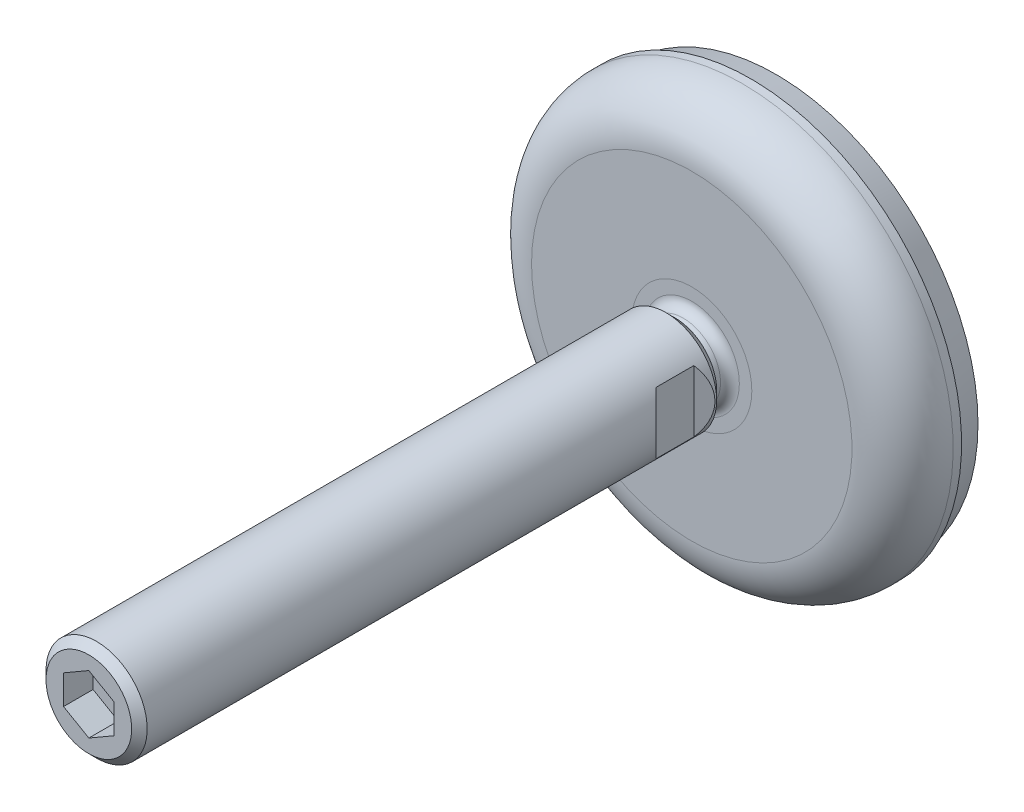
ISO-10303-21;
HEADER;
FILE_DESCRIPTION(('STEP AP214'),'2;1');
FILE_NAME('part.step','',(''),(''),'','','');
FILE_SCHEMA(('AUTOMOTIVE_DESIGN { 1 0 10303 214 1 1 1 1 }'));
ENDSEC;
DATA;
#1=APPLICATION_CONTEXT('core data for automotive mechanical design processes');
#2=APPLICATION_PROTOCOL_DEFINITION('international standard','automotive_design',2000,#1);
#3=PRODUCT_CONTEXT('',#1,'mechanical');
#4=PRODUCT('Part','Part','',(#3));
#5=PRODUCT_RELATED_PRODUCT_CATEGORY('part','',(#4));
#6=PRODUCT_DEFINITION_FORMATION('','',#4);
#7=PRODUCT_DEFINITION_CONTEXT('part definition',#1,'design');
#8=PRODUCT_DEFINITION('design','',#6,#7);
#9=PRODUCT_DEFINITION_SHAPE('','',#8);
#10=(LENGTH_UNIT() NAMED_UNIT(*) SI_UNIT(.MILLI.,.METRE.));
#11=(NAMED_UNIT(*) PLANE_ANGLE_UNIT() SI_UNIT($,.RADIAN.));
#12=(NAMED_UNIT(*) SI_UNIT($,.STERADIAN.) SOLID_ANGLE_UNIT());
#13=UNCERTAINTY_MEASURE_WITH_UNIT(LENGTH_MEASURE(1.E-05),#10,'distance_accuracy_value','');
#14=(GEOMETRIC_REPRESENTATION_CONTEXT(3) GLOBAL_UNCERTAINTY_ASSIGNED_CONTEXT((#13)) GLOBAL_UNIT_ASSIGNED_CONTEXT((#10,
#11,#12)) REPRESENTATION_CONTEXT('',''));
#15=CARTESIAN_POINT('',(0.,0.,0.));
#16=DIRECTION('',(0.,0.,1.));
#17=DIRECTION('',(1.,0.,0.));
#18=AXIS2_PLACEMENT_3D('',#15,#16,#17);
#19=CARTESIAN_POINT('',(-38.,38.,20.));
#20=CARTESIAN_POINT('',(-38.,-38.,20.));
#21=CARTESIAN_POINT('',(-38.,-38.76,20.));
#22=B_SPLINE_CURVE_WITH_KNOTS('',1,(#19,#20,#21),.UNSPECIFIED.,.F.,.F.,(2,1,2),(0.,1.,1.01),.UNSPECIFIED.);
#23=DIRECTION('',(1.,0.,0.));
#24=VECTOR('',#23,1.);
#25=SURFACE_OF_LINEAR_EXTRUSION('',#22,#24);
#26=CARTESIAN_POINT('',(0.,0.,20.));
#27=DIRECTION('',(0.,0.,1.));
#28=DIRECTION('',(1.,0.,0.));
#29=AXIS2_PLACEMENT_3D('',#26,#27,#28);
#30=CIRCLE('',#29,14.2492451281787);
#31=CARTESIAN_POINT('',(14.2492451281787,0.,20.));
#32=VERTEX_POINT('',#31);
#33=EDGE_CURVE('E514',#32,#32,#30,.T.);
#34=ORIENTED_EDGE('',*,*,#33,.F.);
#35=EDGE_LOOP('',(#34));
#36=FACE_BOUND('',#35,.T.);
#37=CARTESIAN_POINT('',(0.,0.,20.));
#38=DIRECTION('',(0.,0.,-1.));
#39=DIRECTION('',(-1.,0.,0.));
#40=AXIS2_PLACEMENT_3D('',#37,#38,#39);
#41=CIRCLE('',#40,38.);
#42=CARTESIAN_POINT('',(-38.,0.,20.));
#43=VERTEX_POINT('',#42);
#44=EDGE_CURVE('E205',#43,#43,#41,.T.);
#45=ORIENTED_EDGE('',*,*,#44,.F.);
#46=EDGE_LOOP('',(#45));
#47=FACE_BOUND('',#46,.T.);
#48=ADVANCED_FACE('F14',(#36,#47),#25,.T.);
#49=CARTESIAN_POINT('',(0.,0.,8.));
#50=DIRECTION('',(0.,0.,-1.));
#51=DIRECTION('',(-1.,0.,0.));
#52=AXIS2_PLACEMENT_3D('',#49,#50,#51);
#53=TOROIDAL_SURFACE('',#52,38.,12.);
#54=ORIENTED_EDGE('',*,*,#44,.T.);
#55=EDGE_LOOP('',(#54));
#56=FACE_BOUND('',#55,.T.);
#57=CARTESIAN_POINT('',(0.,0.,8.));
#58=DIRECTION('',(0.,0.,-1.));
#59=DIRECTION('',(0.,1.,0.));
#60=AXIS2_PLACEMENT_3D('',#57,#58,#59);
#61=CIRCLE('',#60,50.);
#62=CARTESIAN_POINT('',(0.,50.,8.));
#63=VERTEX_POINT('',#62);
#64=EDGE_CURVE('E201',#63,#63,#61,.T.);
#65=ORIENTED_EDGE('',*,*,#64,.F.);
#66=EDGE_LOOP('',(#65));
#67=FACE_BOUND('',#66,.T.);
#68=ADVANCED_FACE('F188',(#56,#67),#53,.T.);
#69=CARTESIAN_POINT('',(0.,0.,6.));
#70=DIRECTION('',(0.,0.,-1.));
#71=DIRECTION('',(-1.,0.,0.));
#72=AXIS2_PLACEMENT_3D('',#69,#70,#71);
#73=CYLINDRICAL_SURFACE('',#72,50.);
#74=CARTESIAN_POINT('',(0.,0.,6.));
#75=DIRECTION('',(0.,0.,-1.));
#76=DIRECTION('',(-1.,0.,0.));
#77=AXIS2_PLACEMENT_3D('',#74,#75,#76);
#78=CIRCLE('',#77,50.);
#79=CARTESIAN_POINT('',(-50.,0.,6.));
#80=VERTEX_POINT('',#79);
#81=EDGE_CURVE('E204',#80,#80,#78,.T.);
#82=ORIENTED_EDGE('',*,*,#81,.F.);
#83=EDGE_LOOP('',(#82));
#84=FACE_BOUND('',#83,.T.);
#85=ORIENTED_EDGE('',*,*,#64,.T.);
#86=EDGE_LOOP('',(#85));
#87=FACE_BOUND('',#86,.T.);
#88=ADVANCED_FACE('F184',(#84,#87),#73,.T.);
#89=CARTESIAN_POINT('',(-50.6000021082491,-50.,6.));
#90=DIRECTION('',(0.,0.,-1.));
#91=DIRECTION('',(0.,1.,0.));
#92=AXIS2_PLACEMENT_3D('',#89,#90,#91);
#93=PLANE('',#92);
#94=CARTESIAN_POINT('',(0.,0.,6.));
#95=DIRECTION('',(0.,0.,1.));
#96=DIRECTION('',(1.,0.,0.));
#97=AXIS2_PLACEMENT_3D('',#94,#95,#96);
#98=CIRCLE('',#97,49.5);
#99=CARTESIAN_POINT('',(49.5,0.,6.));
#100=VERTEX_POINT('',#99);
#101=EDGE_CURVE('E214',#100,#100,#98,.F.);
#102=ORIENTED_EDGE('',*,*,#101,.F.);
#103=EDGE_LOOP('',(#102));
#104=FACE_BOUND('',#103,.T.);
#105=ORIENTED_EDGE('',*,*,#81,.T.);
#106=EDGE_LOOP('',(#105));
#107=FACE_BOUND('',#106,.T.);
#108=ADVANCED_FACE('F176',(#104,#107),#93,.T.);
#109=CARTESIAN_POINT('',(-48.4670146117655,-47.8923048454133,0.));
#110=DIRECTION('',(0.,0.,-1.));
#111=DIRECTION('',(0.,1.,0.));
#112=AXIS2_PLACEMENT_3D('',#109,#110,#111);
#113=PLANE('',#112);
#114=CARTESIAN_POINT('',(0.,0.,0.));
#115=DIRECTION('',(0.,0.,1.));
#116=DIRECTION('',(1.,0.,0.));
#117=AXIS2_PLACEMENT_3D('',#114,#115,#116);
#118=CIRCLE('',#117,47.8923048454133);
#119=CARTESIAN_POINT('',(47.8923048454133,0.,0.));
#120=VERTEX_POINT('',#119);
#121=EDGE_CURVE('E210',#120,#120,#118,.T.);
#122=ORIENTED_EDGE('',*,*,#121,.F.);
#123=EDGE_LOOP('',(#122));
#124=FACE_BOUND('',#123,.T.);
#125=ADVANCED_FACE('F166',(#124),#113,.T.);
#126=CARTESIAN_POINT('',(0.,0.,0.));
#127=DIRECTION('',(0.,0.,1.));
#128=DIRECTION('',(1.,0.,0.));
#129=AXIS2_PLACEMENT_3D('',#126,#127,#128);
#130=CONICAL_SURFACE('',#129,47.8923048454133,0.261799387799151);
#131=ORIENTED_EDGE('',*,*,#101,.T.);
#132=EDGE_LOOP('',(#131));
#133=FACE_BOUND('',#132,.T.);
#134=ORIENTED_EDGE('',*,*,#121,.T.);
#135=EDGE_LOOP('',(#134));
#136=FACE_BOUND('',#135,.T.);
#137=ADVANCED_FACE('F163',(#133,#136),#130,.T.);
#138=CARTESIAN_POINT('',(0.,0.,19.908154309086));
#139=DIRECTION('',(0.,0.,1.));
#140=DIRECTION('',(1.,0.,0.));
#141=AXIS2_PLACEMENT_3D('',#138,#139,#140);
#142=DEGENERATE_TOROIDAL_SURFACE('',#141,1.96062186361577,11.,.F.);
#143=CARTESIAN_POINT('',(0.,0.,22.0200285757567));
#144=DIRECTION('',(0.,0.,1.));
#145=DIRECTION('',(1.,0.,0.));
#146=AXIS2_PLACEMENT_3D('',#143,#144,#145);
#147=CIRCLE('',#146,8.83474691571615);
#148=CARTESIAN_POINT('',(8.83474691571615,0.,22.0200285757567));
#149=VERTEX_POINT('',#148);
#150=EDGE_CURVE('E263',#149,#149,#147,.T.);
#151=ORIENTED_EDGE('',*,*,#150,.T.);
#152=EDGE_LOOP('',(#151));
#153=FACE_BOUND('',#152,.T.);
#154=CARTESIAN_POINT('',(0.,0.,24.));
#155=DIRECTION('',(0.,0.,1.));
#156=DIRECTION('',(1.,0.,0.));
#157=AXIS2_PLACEMENT_3D('',#154,#155,#156);
#158=CIRCLE('',#157,8.25);
#159=CARTESIAN_POINT('',(8.25,0.,24.));
#160=VERTEX_POINT('',#159);
#161=EDGE_CURVE('E261',#160,#160,#158,.T.);
#162=ORIENTED_EDGE('',*,*,#161,.F.);
#163=EDGE_LOOP('',(#162));
#164=FACE_BOUND('',#163,.T.);
#165=ADVANCED_FACE('F165',(#153,#164),#142,.F.);
#166=CARTESIAN_POINT('',(0.,0.,22.5));
#167=DIRECTION('',(0.,0.,1.));
#168=DIRECTION('',(1.,0.,0.));
#169=AXIS2_PLACEMENT_3D('',#166,#167,#168);
#170=TOROIDAL_SURFACE('',#169,11.2882398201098,2.5);
#171=CARTESIAN_POINT('',(0.,0.,20.));
#172=DIRECTION('',(0.,0.,1.));
#173=DIRECTION('',(1.,0.,0.));
#174=AXIS2_PLACEMENT_3D('',#171,#172,#173);
#175=CIRCLE('',#174,11.2882398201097);
#176=CARTESIAN_POINT('',(11.2882398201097,0.,20.));
#177=VERTEX_POINT('',#176);
#178=EDGE_CURVE('E268',#177,#177,#175,.T.);
#179=ORIENTED_EDGE('',*,*,#178,.T.);
#180=EDGE_LOOP('',(#179));
#181=FACE_BOUND('',#180,.T.);
#182=ORIENTED_EDGE('',*,*,#150,.F.);
#183=EDGE_LOOP('',(#182));
#184=FACE_BOUND('',#183,.T.);
#185=ADVANCED_FACE('F173',(#181,#184),#170,.F.);
#186=CARTESIAN_POINT('',(-14.2492451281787,0.,20.));
#187=DIRECTION('',(0.,0.,1.));
#188=DIRECTION('',(1.,0.,0.));
#189=AXIS2_PLACEMENT_3D('',#186,#187,#188);
#190=PLANE('',#189);
#191=ORIENTED_EDGE('',*,*,#33,.T.);
#192=EDGE_LOOP('',(#191));
#193=FACE_BOUND('',#192,.T.);
#194=ORIENTED_EDGE('',*,*,#178,.F.);
#195=EDGE_LOOP('',(#194));
#196=FACE_BOUND('',#195,.T.);
#197=ADVANCED_FACE('F341',(#193,#196),#190,.T.);
#198=CARTESIAN_POINT('',(-6.,-7.01134166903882,156.));
#199=DIRECTION('',(0.,0.,1.));
#200=DIRECTION('',(1.,0.,0.));
#201=AXIS2_PLACEMENT_3D('',#198,#199,#200);
#202=PLANE('',#201);
#203=DIRECTION('',(0.866025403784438,0.5,0.));
#204=VECTOR('',#203,1.);
#205=CARTESIAN_POINT('',(-3.,5.19615242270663,156.));
#206=LINE('',#205,#204);
#207=CARTESIAN_POINT('',(-6.,3.46410161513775,156.));
#208=VERTEX_POINT('',#207);
#209=CARTESIAN_POINT('',(1.08255773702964E-07,6.92820316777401,156.));
#210=VERTEX_POINT('',#209);
#211=EDGE_CURVE('E138',#208,#210,#206,.T.);
#212=ORIENTED_EDGE('',*,*,#211,.F.);
#213=DIRECTION('',(0.,1.,0.));
#214=VECTOR('',#213,1.);
#215=CARTESIAN_POINT('',(-6.,0.,156.));
#216=LINE('',#215,#214);
#217=CARTESIAN_POINT('',(-6.,-3.46410161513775,156.));
#218=VERTEX_POINT('',#217);
#219=EDGE_CURVE('E72',#218,#208,#216,.T.);
#220=ORIENTED_EDGE('',*,*,#219,.F.);
#221=DIRECTION('',(-0.866025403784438,0.5,0.));
#222=VECTOR('',#221,1.);
#223=CARTESIAN_POINT('',(-3.,-5.19615242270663,156.));
#224=LINE('',#223,#222);
#225=CARTESIAN_POINT('',(-2.16511547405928E-07,-6.92820310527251,156.));
#226=VERTEX_POINT('',#225);
#227=EDGE_CURVE('E68',#226,#218,#224,.T.);
#228=ORIENTED_EDGE('',*,*,#227,.F.);
#229=DIRECTION('',(-0.866025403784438,-0.5,0.));
#230=VECTOR('',#229,1.);
#231=CARTESIAN_POINT('',(3.,-5.19615242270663,156.));
#232=LINE('',#231,#230);
#233=CARTESIAN_POINT('',(6.,-3.46410161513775,156.));
#234=VERTEX_POINT('',#233);
#235=EDGE_CURVE('E91',#234,#226,#232,.T.);
#236=ORIENTED_EDGE('',*,*,#235,.F.);
#237=DIRECTION('',(0.,-1.,0.));
#238=VECTOR('',#237,1.);
#239=CARTESIAN_POINT('',(6.,0.,156.));
#240=LINE('',#239,#238);
#241=CARTESIAN_POINT('',(6.,3.46410161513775,156.));
#242=VERTEX_POINT('',#241);
#243=EDGE_CURVE('E149',#242,#234,#240,.T.);
#244=ORIENTED_EDGE('',*,*,#243,.F.);
#245=DIRECTION('',(0.866025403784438,-0.5,0.));
#246=VECTOR('',#245,1.);
#247=CARTESIAN_POINT('',(3.,5.19615242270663,156.));
#248=LINE('',#247,#246);
#249=EDGE_CURVE('E142',#210,#242,#248,.T.);
#250=ORIENTED_EDGE('',*,*,#249,.F.);
#251=EDGE_LOOP('',(#212,#220,#228,#236,#244,#250));
#252=FACE_BOUND('',#251,.T.);
#253=ADVANCED_FACE('F338',(#252),#202,.T.);
#254=CARTESIAN_POINT('',(6.,3.46410161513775,163.));
#255=DIRECTION('',(-0.5,-0.866025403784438,0.));
#256=DIRECTION('',(-0.866025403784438,0.5,0.));
#257=AXIS2_PLACEMENT_3D('',#254,#255,#256);
#258=PLANE('',#257);
#259=ORIENTED_EDGE('',*,*,#249,.T.);
#260=DIRECTION('',(0.,0.,-1.));
#261=VECTOR('',#260,1.);
#262=CARTESIAN_POINT('',(6.,3.46410161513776,163.));
#263=LINE('',#262,#261);
#264=CARTESIAN_POINT('',(6.,3.46410161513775,163.));
#265=VERTEX_POINT('',#264);
#266=EDGE_CURVE('E146',#265,#242,#263,.T.);
#267=ORIENTED_EDGE('',*,*,#266,.F.);
#268=CARTESIAN_POINT('',(0.,6.92820323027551,163.));
#269=CARTESIAN_POINT('',(0.25,6.7838656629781,163.));
#270=CARTESIAN_POINT('',(0.5,6.6395280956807,163.));
#271=CARTESIAN_POINT('',(1.,6.35085296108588,163.));
#272=CARTESIAN_POINT('',(1.25,6.20651539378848,163.));
#273=CARTESIAN_POINT('',(1.75,5.91784025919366,163.));
#274=CARTESIAN_POINT('',(2.,5.77350269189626,163.));
#275=CARTESIAN_POINT('',(2.5,5.48482755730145,163.));
#276=CARTESIAN_POINT('',(2.75,5.34048999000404,163.));
#277=CARTESIAN_POINT('',(3.25,5.05181485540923,163.));
#278=CARTESIAN_POINT('',(3.5,4.90747728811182,163.));
#279=CARTESIAN_POINT('',(4.,4.61880215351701,163.));
#280=CARTESIAN_POINT('',(4.25,4.4744645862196,163.));
#281=CARTESIAN_POINT('',(4.75,4.18578945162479,163.));
#282=CARTESIAN_POINT('',(5.,4.04145188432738,163.));
#283=CARTESIAN_POINT('',(5.5,3.75277674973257,163.));
#284=CARTESIAN_POINT('',(5.75,3.60843918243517,163.));
#285=CARTESIAN_POINT('',(6.,3.46410161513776,163.));
#286=B_SPLINE_CURVE_WITH_KNOTS('',3,(#268,#269,#270,#271,#272,#273,#274,#275,#276,#277,#278,
#279,#280,#281,#282,#283,#284,#285),.UNSPECIFIED.,.F.,.F.,(4,2,2,2,2,2,2,2,4),(0.,
0.86602540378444,1.73205080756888,2.59807621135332,3.46410161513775,4.33012701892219,
5.19615242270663,6.06217782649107,6.92820323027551),.UNSPECIFIED.);
#287=CARTESIAN_POINT('',(-6.25386938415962E-08,6.92820319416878,163.));
#288=VERTEX_POINT('',#287);
#289=EDGE_CURVE('E120',#288,#265,#286,.T.);
#290=ORIENTED_EDGE('',*,*,#289,.F.);
#291=DIRECTION('',(0.,0.,-1.));
#292=VECTOR('',#291,1.);
#293=CARTESIAN_POINT('',(0.,6.92820323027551,163.));
#294=LINE('',#293,#292);
#295=EDGE_CURVE('E135',#288,#210,#294,.T.);
#296=ORIENTED_EDGE('',*,*,#295,.T.);
#297=EDGE_LOOP('',(#259,#267,#290,#296));
#298=FACE_BOUND('',#297,.T.);
#299=ADVANCED_FACE('F144',(#298),#258,.T.);
#300=CARTESIAN_POINT('',(0.,6.92820323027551,163.));
#301=DIRECTION('',(0.5,-0.866025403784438,0.));
#302=DIRECTION('',(-0.866025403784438,-0.5,0.));
#303=AXIS2_PLACEMENT_3D('',#300,#301,#302);
#304=PLANE('',#303);
#305=ORIENTED_EDGE('',*,*,#211,.T.);
#306=ORIENTED_EDGE('',*,*,#295,.F.);
#307=CARTESIAN_POINT('',(-6.,3.46410161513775,163.));
#308=CARTESIAN_POINT('',(-5.75,3.60843918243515,163.));
#309=CARTESIAN_POINT('',(-5.5,3.75277674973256,163.));
#310=CARTESIAN_POINT('',(-5.,4.04145188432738,163.));
#311=CARTESIAN_POINT('',(-4.75,4.18578945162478,163.));
#312=CARTESIAN_POINT('',(-4.25,4.4744645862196,163.));
#313=CARTESIAN_POINT('',(-4.,4.618802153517,163.));
#314=CARTESIAN_POINT('',(-3.5,4.90747728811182,163.));
#315=CARTESIAN_POINT('',(-3.25,5.05181485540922,163.));
#316=CARTESIAN_POINT('',(-2.75,5.34048999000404,163.));
#317=CARTESIAN_POINT('',(-2.5,5.48482755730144,163.));
#318=CARTESIAN_POINT('',(-2.,5.77350269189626,163.));
#319=CARTESIAN_POINT('',(-1.75,5.91784025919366,163.));
#320=CARTESIAN_POINT('',(-1.25,6.20651539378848,163.));
#321=CARTESIAN_POINT('',(-1.,6.35085296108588,163.));
#322=CARTESIAN_POINT('',(-0.5,6.63952809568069,163.));
#323=CARTESIAN_POINT('',(-0.249999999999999,6.7838656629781,163.));
#324=CARTESIAN_POINT('',(0.,6.92820323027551,163.));
#325=B_SPLINE_CURVE_WITH_KNOTS('',3,(#307,#308,#309,#310,#311,#312,#313,#314,#315,#316,#317,
#318,#319,#320,#321,#322,#323,#324),.UNSPECIFIED.,.F.,.F.,(4,2,2,2,2,2,2,2,4),(0.,
0.866025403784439,1.73205080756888,2.59807621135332,3.46410161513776,4.33012701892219,
5.19615242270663,6.06217782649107,6.92820323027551),.UNSPECIFIED.);
#326=CARTESIAN_POINT('',(-6.,3.46410161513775,163.));
#327=VERTEX_POINT('',#326);
#328=EDGE_CURVE('E82',#327,#288,#325,.T.);
#329=ORIENTED_EDGE('',*,*,#328,.F.);
#330=DIRECTION('',(0.,0.,-1.));
#331=VECTOR('',#330,1.);
#332=CARTESIAN_POINT('',(-6.,3.46410161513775,163.));
#333=LINE('',#332,#331);
#334=EDGE_CURVE('E78',#327,#208,#333,.T.);
#335=ORIENTED_EDGE('',*,*,#334,.T.);
#336=EDGE_LOOP('',(#305,#306,#329,#335));
#337=FACE_BOUND('',#336,.T.);
#338=ADVANCED_FACE('F132',(#337),#304,.T.);
#339=CARTESIAN_POINT('',(-6.,3.46410161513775,163.));
#340=DIRECTION('',(1.,0.,0.));
#341=DIRECTION('',(0.,-1.,0.));
#342=AXIS2_PLACEMENT_3D('',#339,#340,#341);
#343=PLANE('',#342);
#344=ORIENTED_EDGE('',*,*,#219,.T.);
#345=ORIENTED_EDGE('',*,*,#334,.F.);
#346=DIRECTION('',(0.,1.,0.));
#347=VECTOR('',#346,1.);
#348=CARTESIAN_POINT('',(-6.,0.,163.));
#349=LINE('',#348,#347);
#350=CARTESIAN_POINT('',(-6.,-3.46410161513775,163.));
#351=VERTEX_POINT('',#350);
#352=EDGE_CURVE('E75',#351,#327,#349,.T.);
#353=ORIENTED_EDGE('',*,*,#352,.F.);
#354=DIRECTION('',(0.,0.,-1.));
#355=VECTOR('',#354,1.);
#356=CARTESIAN_POINT('',(-6.,-3.46410161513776,163.));
#357=LINE('',#356,#355);
#358=EDGE_CURVE('E59',#351,#218,#357,.T.);
#359=ORIENTED_EDGE('',*,*,#358,.T.);
#360=EDGE_LOOP('',(#344,#345,#353,#359));
#361=FACE_BOUND('',#360,.T.);
#362=ADVANCED_FACE('F76',(#361),#343,.T.);
#363=CARTESIAN_POINT('',(-6.,-3.46410161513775,163.));
#364=DIRECTION('',(0.5,0.866025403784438,0.));
#365=DIRECTION('',(0.866025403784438,-0.5,0.));
#366=AXIS2_PLACEMENT_3D('',#363,#364,#365);
#367=PLANE('',#366);
#368=ORIENTED_EDGE('',*,*,#227,.T.);
#369=ORIENTED_EDGE('',*,*,#358,.F.);
#370=CARTESIAN_POINT('',(0.,-6.92820323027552,163.));
#371=CARTESIAN_POINT('',(-0.250000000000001,-6.78386566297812,163.));
#372=CARTESIAN_POINT('',(-0.500000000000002,-6.63952809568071,163.));
#373=CARTESIAN_POINT('',(-1.,-6.3508529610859,163.));
#374=CARTESIAN_POINT('',(-1.25,-6.20651539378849,163.));
#375=CARTESIAN_POINT('',(-1.75,-5.91784025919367,163.));
#376=CARTESIAN_POINT('',(-2.,-5.77350269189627,163.));
#377=CARTESIAN_POINT('',(-2.5,-5.48482755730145,163.));
#378=CARTESIAN_POINT('',(-2.75,-5.34048999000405,163.));
#379=CARTESIAN_POINT('',(-3.25,-5.05181485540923,163.));
#380=CARTESIAN_POINT('',(-3.5,-4.90747728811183,163.));
#381=CARTESIAN_POINT('',(-4.,-4.61880215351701,163.));
#382=CARTESIAN_POINT('',(-4.25,-4.47446458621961,163.));
#383=CARTESIAN_POINT('',(-4.75,-4.18578945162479,163.));
#384=CARTESIAN_POINT('',(-5.,-4.04145188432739,163.));
#385=CARTESIAN_POINT('',(-5.5,-3.75277674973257,163.));
#386=CARTESIAN_POINT('',(-5.75,-3.60843918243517,163.));
#387=CARTESIAN_POINT('',(-6.,-3.46410161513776,163.));
#388=B_SPLINE_CURVE_WITH_KNOTS('',3,(#370,#371,#372,#373,#374,#375,#376,#377,#378,#379,#380,
#381,#382,#383,#384,#385,#386,#387),.UNSPECIFIED.,.F.,.F.,(4,2,2,2,2,2,2,2,4),(0.,
0.86602540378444,1.73205080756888,2.59807621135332,3.46410161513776,4.3301270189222,
5.19615242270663,6.06217782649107,6.92820323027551),.UNSPECIFIED.);
#389=CARTESIAN_POINT('',(-6.25386938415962E-08,-6.92820319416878,163.));
#390=VERTEX_POINT('',#389);
#391=EDGE_CURVE('E64',#390,#351,#388,.T.);
#392=ORIENTED_EDGE('',*,*,#391,.F.);
#393=DIRECTION('',(0.,0.,-1.));
#394=VECTOR('',#393,1.);
#395=CARTESIAN_POINT('',(0.,-6.92820323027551,163.));
#396=LINE('',#395,#394);
#397=EDGE_CURVE('E89',#226,#390,#396,.F.);
#398=ORIENTED_EDGE('',*,*,#397,.F.);
#399=EDGE_LOOP('',(#368,#369,#392,#398));
#400=FACE_BOUND('',#399,.T.);
#401=ADVANCED_FACE('F61',(#400),#367,.T.);
#402=CARTESIAN_POINT('',(0.,-6.92820323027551,163.));
#403=DIRECTION('',(-0.5,0.866025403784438,0.));
#404=DIRECTION('',(0.866025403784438,0.5,0.));
#405=AXIS2_PLACEMENT_3D('',#402,#403,#404);
#406=PLANE('',#405);
#407=ORIENTED_EDGE('',*,*,#235,.T.);
#408=ORIENTED_EDGE('',*,*,#397,.T.);
#409=CARTESIAN_POINT('',(6.,-3.46410161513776,163.));
#410=CARTESIAN_POINT('',(5.75,-3.60843918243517,163.));
#411=CARTESIAN_POINT('',(5.5,-3.75277674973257,163.));
#412=CARTESIAN_POINT('',(5.,-4.04145188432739,163.));
#413=CARTESIAN_POINT('',(4.75,-4.18578945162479,163.));
#414=CARTESIAN_POINT('',(4.25,-4.47446458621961,163.));
#415=CARTESIAN_POINT('',(4.,-4.61880215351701,163.));
#416=CARTESIAN_POINT('',(3.5,-4.90747728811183,163.));
#417=CARTESIAN_POINT('',(3.25,-5.05181485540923,163.));
#418=CARTESIAN_POINT('',(2.75,-5.34048999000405,163.));
#419=CARTESIAN_POINT('',(2.5,-5.48482755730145,163.));
#420=CARTESIAN_POINT('',(2.,-5.77350269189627,163.));
#421=CARTESIAN_POINT('',(1.75,-5.91784025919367,163.));
#422=CARTESIAN_POINT('',(1.25,-6.20651539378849,163.));
#423=CARTESIAN_POINT('',(0.999999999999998,-6.3508529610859,163.));
#424=CARTESIAN_POINT('',(0.499999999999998,-6.63952809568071,163.));
#425=CARTESIAN_POINT('',(0.249999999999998,-6.78386566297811,163.));
#426=CARTESIAN_POINT('',(0.,-6.92820323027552,163.));
#427=B_SPLINE_CURVE_WITH_KNOTS('',3,(#409,#410,#411,#412,#413,#414,#415,#416,#417,#418,#419,
#420,#421,#422,#423,#424,#425,#426),.UNSPECIFIED.,.F.,.F.,(4,2,2,2,2,2,2,2,4),(0.,
0.866025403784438,1.73205080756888,2.59807621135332,3.46410161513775,4.33012701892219,
5.19615242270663,6.06217782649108,6.92820323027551),.UNSPECIFIED.);
#428=CARTESIAN_POINT('',(6.,-3.46410161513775,163.));
#429=VERTEX_POINT('',#428);
#430=EDGE_CURVE('E88',#429,#390,#427,.T.);
#431=ORIENTED_EDGE('',*,*,#430,.F.);
#432=DIRECTION('',(0.,0.,-1.));
#433=VECTOR('',#432,1.);
#434=CARTESIAN_POINT('',(6.,-3.46410161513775,163.));
#435=LINE('',#434,#433);
#436=EDGE_CURVE('E37',#429,#234,#435,.T.);
#437=ORIENTED_EDGE('',*,*,#436,.T.);
#438=EDGE_LOOP('',(#407,#408,#431,#437));
#439=FACE_BOUND('',#438,.T.);
#440=ADVANCED_FACE('F111',(#439),#406,.T.);
#441=CARTESIAN_POINT('',(6.,-3.46410161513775,163.));
#442=DIRECTION('',(-1.,0.,0.));
#443=DIRECTION('',(0.,1.,0.));
#444=AXIS2_PLACEMENT_3D('',#441,#442,#443);
#445=PLANE('',#444);
#446=ORIENTED_EDGE('',*,*,#243,.T.);
#447=ORIENTED_EDGE('',*,*,#436,.F.);
#448=DIRECTION('',(0.,-1.,0.));
#449=VECTOR('',#448,1.);
#450=CARTESIAN_POINT('',(6.,0.,163.));
#451=LINE('',#450,#449);
#452=EDGE_CURVE('E123',#265,#429,#451,.T.);
#453=ORIENTED_EDGE('',*,*,#452,.F.);
#454=ORIENTED_EDGE('',*,*,#266,.T.);
#455=EDGE_LOOP('',(#446,#447,#453,#454));
#456=FACE_BOUND('',#455,.T.);
#457=ADVANCED_FACE('F151',(#456),#445,.T.);
#458=CARTESIAN_POINT('',(-10.2814161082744,10.1595,163.));
#459=DIRECTION('',(0.,0.,1.));
#460=DIRECTION('',(0.,-1.,0.));
#461=AXIS2_PLACEMENT_3D('',#458,#459,#460);
#462=PLANE('',#461);
#463=ORIENTED_EDGE('',*,*,#452,.T.);
#464=ORIENTED_EDGE('',*,*,#430,.T.);
#465=ORIENTED_EDGE('',*,*,#391,.T.);
#466=ORIENTED_EDGE('',*,*,#352,.T.);
#467=ORIENTED_EDGE('',*,*,#328,.T.);
#468=ORIENTED_EDGE('',*,*,#289,.T.);
#469=EDGE_LOOP('',(#463,#464,#465,#466,#467,#468));
#470=FACE_BOUND('',#469,.T.);
#471=CARTESIAN_POINT('',(0.,0.,163.));
#472=DIRECTION('',(0.,0.,-1.));
#473=DIRECTION('',(-1.,0.,0.));
#474=AXIS2_PLACEMENT_3D('',#471,#472,#473);
#475=CIRCLE('',#474,10.1595);
#476=CARTESIAN_POINT('',(-10.1595,0.,163.));
#477=VERTEX_POINT('',#476);
#478=EDGE_CURVE('E209',#477,#477,#475,.T.);
#479=ORIENTED_EDGE('',*,*,#478,.F.);
#480=EDGE_LOOP('',(#479));
#481=FACE_BOUND('',#480,.T.);
#482=ADVANCED_FACE('F86',(#470,#481),#462,.T.);
#483=CARTESIAN_POINT('',(0.,0.,163.));
#484=DIRECTION('',(0.,0.,-1.));
#485=DIRECTION('',(-1.,0.,0.));
#486=AXIS2_PLACEMENT_3D('',#483,#484,#485);
#487=CONICAL_SURFACE('',#486,10.1595,0.78539816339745);
#488=CARTESIAN_POINT('',(0.,0.,161.1595));
#489=DIRECTION('',(0.,0.,-1.));
#490=DIRECTION('',(0.,1.,0.));
#491=AXIS2_PLACEMENT_3D('',#488,#489,#490);
#492=CIRCLE('',#491,12.);
#493=CARTESIAN_POINT('',(0.,12.,161.1595));
#494=VERTEX_POINT('',#493);
#495=EDGE_CURVE('E206',#494,#494,#492,.T.);
#496=ORIENTED_EDGE('',*,*,#495,.F.);
#497=EDGE_LOOP('',(#496));
#498=FACE_BOUND('',#497,.T.);
#499=ORIENTED_EDGE('',*,*,#478,.T.);
#500=EDGE_LOOP('',(#499));
#501=FACE_BOUND('',#500,.T.);
#502=ADVANCED_FACE('F160',(#498,#501),#487,.T.);
#503=CARTESIAN_POINT('',(-9.5,-15.,38.));
#504=DIRECTION('',(0.707106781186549,0.,0.707106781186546));
#505=DIRECTION('',(0.707106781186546,0.,-0.707106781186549));
#506=AXIS2_PLACEMENT_3D('',#503,#504,#505);
#507=PLANE('',#506);
#508=DIRECTION('',(0.,1.,0.));
#509=VECTOR('',#508,1.);
#510=CARTESIAN_POINT('',(-9.5,-15.,38.));
#511=LINE('',#510,#509);
#512=CARTESIAN_POINT('',(-9.5,-7.33143914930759,38.));
#513=VERTEX_POINT('',#512);
#514=CARTESIAN_POINT('',(-9.5,7.33143914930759,38.));
#515=VERTEX_POINT('',#514);
#516=EDGE_CURVE('E273',#513,#515,#511,.T.);
#517=ORIENTED_EDGE('',*,*,#516,.F.);
#518=CARTESIAN_POINT('',(0.,0.,28.5));
#519=DIRECTION('',(0.707106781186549,0.,0.707106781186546));
#520=DIRECTION('',(0.707106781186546,0.,-0.707106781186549));
#521=AXIS2_PLACEMENT_3D('',#518,#519,#520);
#522=ELLIPSE('',#521,16.9705627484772,12.);
#523=EDGE_CURVE('E213',#513,#515,#522,.F.);
#524=ORIENTED_EDGE('',*,*,#523,.T.);
#525=EDGE_LOOP('',(#517,#524));
#526=FACE_BOUND('',#525,.T.);
#527=ADVANCED_FACE('F332',(#526),#507,.F.);
#528=CARTESIAN_POINT('',(-12.,-15.,26.5));
#529=DIRECTION('',(0.707106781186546,0.,-0.707106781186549));
#530=DIRECTION('',(-0.707106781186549,0.,-0.707106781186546));
#531=AXIS2_PLACEMENT_3D('',#528,#529,#530);
#532=PLANE('',#531);
#533=CARTESIAN_POINT('',(0.,0.,38.5));
#534=DIRECTION('',(0.707106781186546,0.,-0.707106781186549));
#535=DIRECTION('',(-0.707106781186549,0.,-0.707106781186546));
#536=AXIS2_PLACEMENT_3D('',#533,#534,#535);
#537=ELLIPSE('',#536,16.9705627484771,12.);
#538=CARTESIAN_POINT('',(-9.5,7.33143914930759,29.));
#539=VERTEX_POINT('',#538);
#540=CARTESIAN_POINT('',(-9.5,-7.33143914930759,29.));
#541=VERTEX_POINT('',#540);
#542=EDGE_CURVE('E230',#539,#541,#537,.F.);
#543=ORIENTED_EDGE('',*,*,#542,.T.);
#544=DIRECTION('',(0.,1.,0.));
#545=VECTOR('',#544,1.);
#546=CARTESIAN_POINT('',(-9.5,-15.,29.));
#547=LINE('',#546,#545);
#548=EDGE_CURVE('E275',#541,#539,#547,.T.);
#549=ORIENTED_EDGE('',*,*,#548,.T.);
#550=EDGE_LOOP('',(#543,#549));
#551=FACE_BOUND('',#550,.T.);
#552=ADVANCED_FACE('F326',(#551),#532,.F.);
#553=CARTESIAN_POINT('',(-9.5,-15.,29.));
#554=DIRECTION('',(1.,0.,0.));
#555=DIRECTION('',(0.,0.,-1.));
#556=AXIS2_PLACEMENT_3D('',#553,#554,#555);
#557=PLANE('',#556);
#558=DIRECTION('',(0.,0.,-1.));
#559=VECTOR('',#558,1.);
#560=CARTESIAN_POINT('',(-9.5,-7.33143914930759,27.8405));
#561=LINE('',#560,#559);
#562=EDGE_CURVE('E227',#541,#513,#561,.F.);
#563=ORIENTED_EDGE('',*,*,#562,.T.);
#564=ORIENTED_EDGE('',*,*,#516,.T.);
#565=DIRECTION('',(0.,0.,-1.));
#566=VECTOR('',#565,1.);
#567=CARTESIAN_POINT('',(-9.5,7.33143914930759,27.8405));
#568=LINE('',#567,#566);
#569=EDGE_CURVE('E224',#515,#539,#568,.T.);
#570=ORIENTED_EDGE('',*,*,#569,.T.);
#571=ORIENTED_EDGE('',*,*,#548,.F.);
#572=EDGE_LOOP('',(#563,#564,#570,#571));
#573=FACE_BOUND('',#572,.T.);
#574=ADVANCED_FACE('F318',(#573),#557,.F.);
#575=CARTESIAN_POINT('',(9.5,-15.,38.));
#576=DIRECTION('',(-0.707106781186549,0.,0.707106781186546));
#577=DIRECTION('',(0.707106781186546,0.,0.707106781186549));
#578=AXIS2_PLACEMENT_3D('',#575,#576,#577);
#579=PLANE('',#578);
#580=DIRECTION('',(0.,1.,0.));
#581=VECTOR('',#580,1.);
#582=CARTESIAN_POINT('',(9.5,-15.,38.));
#583=LINE('',#582,#581);
#584=CARTESIAN_POINT('',(9.5,-7.33143914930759,38.));
#585=VERTEX_POINT('',#584);
#586=CARTESIAN_POINT('',(9.5,7.33143914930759,38.));
#587=VERTEX_POINT('',#586);
#588=EDGE_CURVE('E265',#585,#587,#583,.T.);
#589=ORIENTED_EDGE('',*,*,#588,.T.);
#590=CARTESIAN_POINT('',(0.,0.,28.5));
#591=DIRECTION('',(-0.707106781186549,0.,0.707106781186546));
#592=DIRECTION('',(-0.707106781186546,0.,-0.707106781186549));
#593=AXIS2_PLACEMENT_3D('',#590,#591,#592);
#594=ELLIPSE('',#593,16.9705627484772,12.);
#595=EDGE_CURVE('E237',#587,#585,#594,.F.);
#596=ORIENTED_EDGE('',*,*,#595,.T.);
#597=EDGE_LOOP('',(#589,#596));
#598=FACE_BOUND('',#597,.T.);
#599=ADVANCED_FACE('F316',(#598),#579,.F.);
#600=CARTESIAN_POINT('',(12.,-15.,26.5));
#601=DIRECTION('',(-0.707106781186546,0.,-0.707106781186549));
#602=DIRECTION('',(-0.707106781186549,0.,0.707106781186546));
#603=AXIS2_PLACEMENT_3D('',#600,#601,#602);
#604=PLANE('',#603);
#605=CARTESIAN_POINT('',(0.,0.,38.5));
#606=DIRECTION('',(-0.707106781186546,0.,-0.707106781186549));
#607=DIRECTION('',(0.707106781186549,0.,-0.707106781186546));
#608=AXIS2_PLACEMENT_3D('',#605,#606,#607);
#609=ELLIPSE('',#608,16.9705627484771,12.);
#610=CARTESIAN_POINT('',(9.5,-7.33143914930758,29.));
#611=VERTEX_POINT('',#610);
#612=CARTESIAN_POINT('',(9.5,7.33143914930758,29.));
#613=VERTEX_POINT('',#612);
#614=EDGE_CURVE('E233',#611,#613,#609,.F.);
#615=ORIENTED_EDGE('',*,*,#614,.T.);
#616=DIRECTION('',(0.,1.,0.));
#617=VECTOR('',#616,1.);
#618=CARTESIAN_POINT('',(9.5,-15.,29.));
#619=LINE('',#618,#617);
#620=EDGE_CURVE('E28',#611,#613,#619,.T.);
#621=ORIENTED_EDGE('',*,*,#620,.F.);
#622=EDGE_LOOP('',(#615,#621));
#623=FACE_BOUND('',#622,.T.);
#624=ADVANCED_FACE('F308',(#623),#604,.F.);
#625=CARTESIAN_POINT('',(9.5,-15.,29.));
#626=DIRECTION('',(-1.,0.,0.));
#627=DIRECTION('',(0.,0.,1.));
#628=AXIS2_PLACEMENT_3D('',#625,#626,#627);
#629=PLANE('',#628);
#630=DIRECTION('',(0.,0.,-1.));
#631=VECTOR('',#630,1.);
#632=CARTESIAN_POINT('',(9.5,7.33143914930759,27.8405));
#633=LINE('',#632,#631);
#634=EDGE_CURVE('E240',#613,#587,#633,.F.);
#635=ORIENTED_EDGE('',*,*,#634,.T.);
#636=ORIENTED_EDGE('',*,*,#588,.F.);
#637=DIRECTION('',(0.,0.,-1.));
#638=VECTOR('',#637,1.);
#639=CARTESIAN_POINT('',(9.5,-7.33143914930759,27.8405));
#640=LINE('',#639,#638);
#641=EDGE_CURVE('E235',#585,#611,#640,.T.);
#642=ORIENTED_EDGE('',*,*,#641,.T.);
#643=ORIENTED_EDGE('',*,*,#620,.T.);
#644=EDGE_LOOP('',(#635,#636,#642,#643));
#645=FACE_BOUND('',#644,.T.);
#646=ADVANCED_FACE('F312',(#645),#629,.F.);
#647=CARTESIAN_POINT('',(0.,0.,27.8405));
#648=DIRECTION('',(0.,0.,-1.));
#649=DIRECTION('',(-1.,0.,0.));
#650=AXIS2_PLACEMENT_3D('',#647,#648,#649);
#651=CYLINDRICAL_SURFACE('',#650,12.);
#652=CARTESIAN_POINT('',(0.,0.,26.1));
#653=DIRECTION('',(0.,0.,1.));
#654=DIRECTION('',(1.,0.,0.));
#655=AXIS2_PLACEMENT_3D('',#652,#653,#654);
#656=CIRCLE('',#655,12.);
#657=CARTESIAN_POINT('',(12.,0.,26.1));
#658=VERTEX_POINT('',#657);
#659=EDGE_CURVE('E22',#658,#658,#656,.T.);
#660=ORIENTED_EDGE('',*,*,#659,.T.);
#661=EDGE_LOOP('',(#660));
#662=FACE_BOUND('',#661,.T.);
#663=ORIENTED_EDGE('',*,*,#634,.F.);
#664=ORIENTED_EDGE('',*,*,#614,.F.);
#665=ORIENTED_EDGE('',*,*,#641,.F.);
#666=ORIENTED_EDGE('',*,*,#595,.F.);
#667=EDGE_LOOP('',(#663,#664,#665,#666));
#668=FACE_BOUND('',#667,.T.);
#669=ORIENTED_EDGE('',*,*,#562,.F.);
#670=ORIENTED_EDGE('',*,*,#542,.F.);
#671=ORIENTED_EDGE('',*,*,#569,.F.);
#672=ORIENTED_EDGE('',*,*,#523,.F.);
#673=EDGE_LOOP('',(#669,#670,#671,#672));
#674=FACE_BOUND('',#673,.T.);
#675=ORIENTED_EDGE('',*,*,#495,.T.);
#676=EDGE_LOOP('',(#675));
#677=FACE_BOUND('',#676,.T.);
#678=ADVANCED_FACE('F245',(#662,#668,#674,#677),#651,.T.);
#679=CARTESIAN_POINT('',(0.,0.,24.));
#680=DIRECTION('',(0.,0.,1.));
#681=DIRECTION('',(1.,0.,0.));
#682=AXIS2_PLACEMENT_3D('',#679,#680,#681);
#683=PLANE('',#682);
#684=CARTESIAN_POINT('',(0.,0.,24.));
#685=DIRECTION('',(0.,0.,1.));
#686=DIRECTION('',(1.,0.,0.));
#687=AXIS2_PLACEMENT_3D('',#684,#685,#686);
#688=CIRCLE('',#687,9.9);
#689=CARTESIAN_POINT('',(9.9,0.,24.));
#690=VERTEX_POINT('',#689);
#691=EDGE_CURVE('E9',#690,#690,#688,.F.);
#692=ORIENTED_EDGE('',*,*,#691,.T.);
#693=EDGE_LOOP('',(#692));
#694=FACE_BOUND('',#693,.T.);
#695=ORIENTED_EDGE('',*,*,#161,.T.);
#696=EDGE_LOOP('',(#695));
#697=FACE_BOUND('',#696,.T.);
#698=ADVANCED_FACE('F249',(#694,#697),#683,.F.);
#699=CARTESIAN_POINT('',(0.,0.,26.1));
#700=DIRECTION('',(0.,0.,1.));
#701=DIRECTION('',(1.,0.,0.));
#702=AXIS2_PLACEMENT_3D('',#699,#700,#701);
#703=CONICAL_SURFACE('',#702,12.,0.78539816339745);
#704=ORIENTED_EDGE('',*,*,#691,.F.);
#705=EDGE_LOOP('',(#704));
#706=FACE_BOUND('',#705,.T.);
#707=ORIENTED_EDGE('',*,*,#659,.F.);
#708=EDGE_LOOP('',(#707));
#709=FACE_BOUND('',#708,.T.);
#710=ADVANCED_FACE('F16',(#706,#709),#703,.T.);
#711=CLOSED_SHELL('',(#48,#68,#88,#108,#125,#137,#165,#185,#197,#253,#299,#338,#362,#401,#440,
#457,#482,#502,#527,#552,#574,#599,#624,#646,#678,#698,#710));
#712=MANIFOLD_SOLID_BREP('B1',#711);
#713=ADVANCED_BREP_SHAPE_REPRESENTATION('',(#18,#712),#14);
#714=SHAPE_DEFINITION_REPRESENTATION(#9,#713);
ENDSEC;
END-ISO-10303-21;
